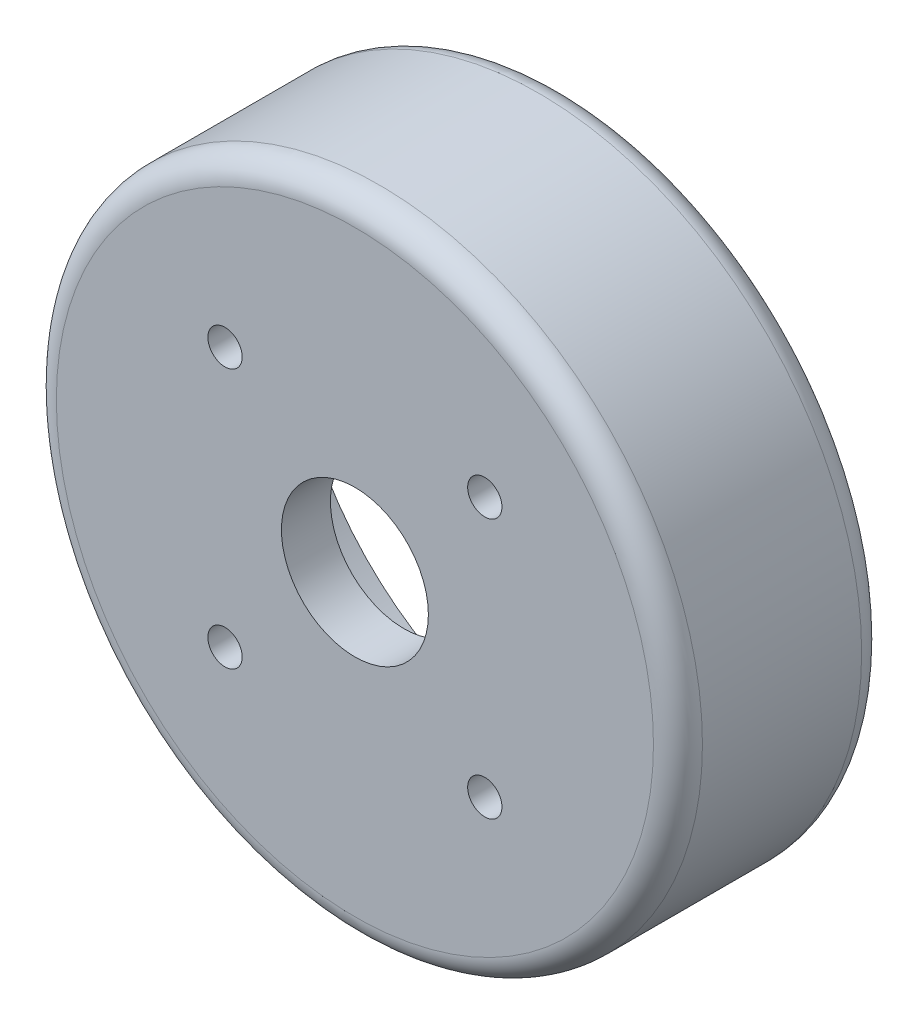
from build123d import *

# Parameters (mm, degrees)
SKETCH1_R           = 33.5026
SKETCH1_R_2         = 28.4226
BOSS_EXTRUDE1_DEPTH = 12.7
BOSS_EXTRUDE2_START = 3.81
SKETCH2_R           = 33.5026
SKETCH2_R_2         = 25.4
BOSS_EXTRUDE2_DEPTH = 3.81
BOSS_EXTRUDE3_START = 5.08
SKETCH3_R           = 33.5026
SKETCH3_R_2         = 7.62
BOSS_EXTRUDE3_DEPTH = 5.08
SKETCH4_R           = 1.778
CUT_EXTRUDE1_DEPTH  = 51.173982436
CUT_EXTRUDE2_DEPTH  = 2.54
FILLET1_R           = 2.54


with BuildPart() as part:
    # Sketch1 → Boss-Extrude1 (new body)
    with BuildSketch(Plane.XY):
        Circle(SKETCH1_R)
        Circle(SKETCH1_R_2, mode=Mode.SUBTRACT)
    extrude(amount=-BOSS_EXTRUDE1_DEPTH)

    # Sketch2 → Boss-Extrude2 (add)
    with BuildSketch(Plane.XY.offset(BOSS_EXTRUDE2_START)):
        Circle(SKETCH2_R)
        with Locations(Location((0, 0, 0), (0, 0, 180))):
            Circle(SKETCH2_R_2, mode=Mode.SUBTRACT)
    extrude(amount=-BOSS_EXTRUDE2_DEPTH)

    # Sketch3 → Boss-Extrude3 (add)
    with BuildSketch(Plane.XY.offset(3.81).offset(BOSS_EXTRUDE3_START)):
        Circle(SKETCH3_R)
        Circle(SKETCH3_R_2, mode=Mode.SUBTRACT)
    extrude(amount=-BOSS_EXTRUDE3_DEPTH)

    # Sketch4 → Cut-Extrude1 (cut, through all)
    with BuildSketch(Plane(origin=(0, 0, 3.81), x_dir=(-1, 0, 0), z_dir=(0, 0, -1))):
        with Locations((13.470384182, -13.470384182)):
            Circle(SKETCH4_R)
        with Locations((-13.470384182, -13.470384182)):
            Circle(SKETCH4_R)
        with Locations((-13.470384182, 13.470384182)):
            Circle(SKETCH4_R)
        with Locations((13.470384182, 13.470384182)):
            Circle(SKETCH4_R)
    extrude(amount=-CUT_EXTRUDE1_DEPTH, mode=Mode.SUBTRACT)

    # Sketch5 → Cut-Extrude2 (cut)
    with BuildSketch(Plane(origin=(0, 0, 3.81), x_dir=(-1, 0, 0), z_dir=(0, 0, -1))):
        Polygon((-8.631034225, 13.470384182), (-11.050709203, 17.661384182), (-15.89005916, 17.661384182), (-18.309734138, 13.470384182), (-15.89005916, 9.279384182), (-11.050709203, 9.279384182), align=None)
        Polygon((8.631034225, 13.470384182), (11.050709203, 9.279384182), (15.89005916, 9.279384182), (18.309734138, 13.470384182), (15.89005916, 17.661384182), (11.050709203, 17.661384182), align=None)
        Polygon((8.631034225, -13.470384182), (11.050709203, -17.661384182), (15.89005916, -17.661384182), (18.309734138, -13.470384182), (15.89005916, -9.279384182), (11.050709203, -9.279384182), align=None)
        Polygon((-8.631034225, -13.470384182), (-11.050709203, -9.279384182), (-15.89005916, -9.279384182), (-18.309734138, -13.470384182), (-15.89005916, -17.661384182), (-11.050709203, -17.661384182), align=None)
    extrude(amount=-CUT_EXTRUDE2_DEPTH, mode=Mode.SUBTRACT)

    # Fillet1
    fillet1_edges = [part.edges().sort_by_distance(p)[0] for p in [
        (-33.5026, 0, 8.89),
        (-33.5026, 0, -12.7),
    ]]
    fillet(fillet1_edges, radius=FILLET1_R)


solid = part.part
